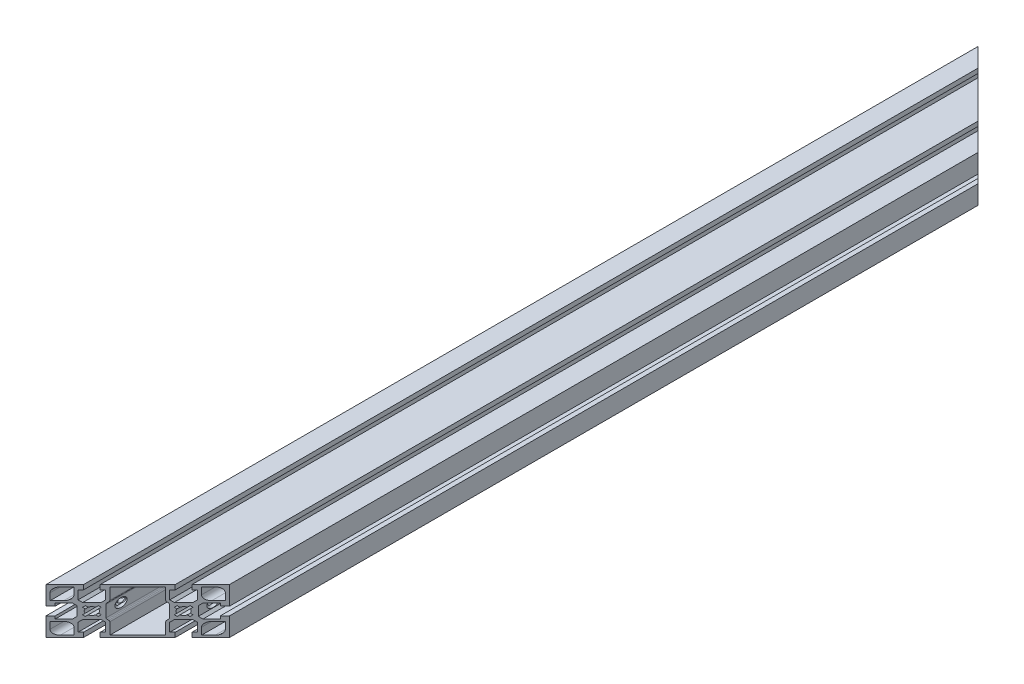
from build123d import *

# Parameters (mm, degrees)
BOSS_EXTRUDE1_DEPTH      = 457.2
BOSS_EXTRUDE1_DEPTH_BACK = 457.2
CUT_EXTRUDE1_DEPTH       = 457.2
SKETCH3_R                = 4.250000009
CUT_EXTRUDE2_DEPTH       = 457.2
SKETCH4_R                = 6.5
SKETCH4_R_2              = 4.250000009
SKETCH4_R_3              = 6.499999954
CUT_EXTRUDE3_DEPTH       = 457.2


with BuildPart() as part:
    # Sketch1 → Boss-Extrude1 (new, two sides: drawn at the far end of the back side and taken through both)
    with BuildSketch(Plane.XY.offset(-BOSS_EXTRUDE1_DEPTH_BACK)):
        Polygon((40.5, 4.1), (45, 4.1), (45, 22.5), (26.6, 22.5), (26.6, 18), (29.3, 18), (29.3, 9.5), (27, 7.2), (18, 7.2), (15.7, 9.5), (15.7, 18), (18.4, 18), (18.4, 22.5), (-18.4, 22.5), (-18.4, 18), (-15.7, 18), (-15.7, 9.5), (-18, 7.2), (-27, 7.2), (-29.3, 9.5), (-29.3, 18), (-26.6, 18), (-26.6, 22.5), (-45, 22.5), (-45, 4.1), (-40.5, 4.1), (-40.5, 6.8), (-32, 6.8), (-29.7, 4.5), (-29.7, -4.5), (-32, -6.8), (-40.5, -6.8), (-40.5, -4.1), (-45, -4.1), (-45, -22.5), (-26.6, -22.5), (-26.6, -18), (-29.3, -18), (-29.3, -9.5), (-27, -7.2), (-18, -7.2), (-15.7, -9.5), (-15.7, -18), (-18.4, -18), (-18.4, -22.5), (18.4, -22.5), (18.4, -18), (15.7, -18), (15.7, -9.5), (18, -7.2), (27, -7.2), (29.3, -9.5), (29.3, -18), (26.6, -18), (26.6, -22.5), (45, -22.5), (45, -4.1), (40.5, -4.1), (40.5, -6.8), (32, -6.8), (29.7, -4.5), (29.7, 4.5), (32, 6.8), (40.5, 6.8), align=None)
        with BuildLine():
            Line((-43, 8.799987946), (-43, 15.5))
            ThreePointArc((-43, 15.5), (-41.535533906, 19.035533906), (-38, 20.5))
            Line((-38, 20.5), (-31.30001823, 20.5))
            Line((-31.30001823, 20.5), (-31.300018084, 13.799988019))
            ThreePointArc((-31.300018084, 13.799988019), (-32.764484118, 10.264454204), (-36.300017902, 8.799988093))
            Line((-36.300017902, 8.799988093), (-43, 8.799987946))
        make_face(mode=Mode.SUBTRACT)
        with BuildLine():
            Line((-43, -15.5), (-43, -8.7999878))
            Line((-43, -8.7999878), (-36.300017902, -8.799987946))
            ThreePointArc((-36.300017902, -8.799987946), (-32.764483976, -10.264454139), (-31.300017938, -13.799988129))
            Line((-31.300017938, -13.799988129), (-31.300018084, -20.5))
            Line((-31.300018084, -20.5), (-38, -20.5))
            ThreePointArc((-38, -20.5), (-41.535533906, -19.035533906), (-43, -15.5))
        make_face(mode=Mode.SUBTRACT)
        with BuildLine():
            Line((31.300018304, -20.5), (31.300018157, -13.799988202))
            ThreePointArc((31.300018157, -13.799988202), (32.764484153, -10.264454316), (36.300017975, -8.799988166))
            Line((36.300017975, -8.799988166), (43, -8.799988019))
            Line((43, -8.799988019), (43, -15.5))
            ThreePointArc((43, -15.5), (41.535533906, -19.035533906), (38, -20.5))
            Line((38, -20.5), (31.300018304, -20.5))
        make_face(mode=Mode.SUBTRACT)
        with BuildLine():
            Line((31.300018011, 13.799988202), (31.300018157, 20.5))
            Line((31.300018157, 20.5), (38, 20.5))
            ThreePointArc((38, 20.5), (41.535533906, 19.035533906), (43, 15.5))
            Line((43, 15.5), (43, 8.799987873))
            Line((43, 8.799987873), (36.300017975, 8.799988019))
            ThreePointArc((36.300017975, 8.799988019), (32.764484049, 10.264454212), (31.300018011, 13.799988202))
        make_face(mode=Mode.SUBTRACT)
        with BuildLine():
            Line((-25.681980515, 4.596194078), (-24.348524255, 3.262737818))
            ThreePointArc((-24.348524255, 3.262737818), (-22.5, 3.749999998), (-20.651475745, 3.262737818))
            Line((-20.651475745, 3.262737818), (-19.318019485, 4.596194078))
            Line((-19.318019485, 4.596194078), (-17.903805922, 3.181980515))
            Line((-17.903805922, 3.181980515), (-19.237262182, 1.848524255))
            ThreePointArc((-19.237262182, 1.848524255), (-18.750000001, 0), (-19.237262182, -1.848524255))
            Line((-19.237262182, -1.848524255), (-17.903805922, -3.181980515))
            Line((-17.903805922, -3.181980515), (-19.318019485, -4.596194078))
            Line((-19.318019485, -4.596194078), (-20.651475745, -3.262737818))
            ThreePointArc((-20.651475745, -3.262737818), (-22.5, -3.749999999), (-24.348524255, -3.262737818))
            Line((-24.348524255, -3.262737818), (-25.681980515, -4.596194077))
            Line((-25.681980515, -4.596194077), (-27.096194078, -3.181980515))
            Line((-27.096194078, -3.181980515), (-25.762737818, -1.848524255))
            ThreePointArc((-25.762737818, -1.848524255), (-26.249999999, 0), (-25.762737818, 1.848524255))
            Line((-25.762737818, 1.848524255), (-27.096194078, 3.181980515))
            Line((-27.096194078, 3.181980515), (-25.681980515, 4.596194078))
        make_face(mode=Mode.SUBTRACT)
        with BuildLine():
            Line((19.318019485, 4.596194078), (20.651475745, 3.262737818))
            ThreePointArc((20.651475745, 3.262737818), (22.5, 3.749999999), (24.348524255, 3.262737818))
            Line((24.348524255, 3.262737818), (25.681980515, 4.596194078))
            Line((25.681980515, 4.596194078), (27.096194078, 3.181980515))
            Line((27.096194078, 3.181980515), (25.762737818, 1.848524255))
            ThreePointArc((25.762737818, 1.848524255), (26.249999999, 0), (25.762737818, -1.848524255))
            Line((25.762737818, -1.848524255), (27.096194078, -3.181980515))
            Line((27.096194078, -3.181980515), (25.681980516, -4.596194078))
            Line((25.681980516, -4.596194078), (24.348524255, -3.262737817))
            ThreePointArc((24.348524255, -3.262737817), (22.5, -3.749999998), (20.651475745, -3.262737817))
            Line((20.651475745, -3.262737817), (19.318019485, -4.596194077))
            Line((19.318019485, -4.596194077), (17.903805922, -3.181980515))
            Line((17.903805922, -3.181980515), (19.237262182, -1.848524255))
            ThreePointArc((19.237262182, -1.848524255), (18.750000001, 0), (19.237262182, 1.848524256))
            Line((19.237262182, 1.848524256), (17.903805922, 3.181980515))
            Line((17.903805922, 3.181980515), (19.318019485, 4.596194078))
        make_face(mode=Mode.SUBTRACT)
        with BuildLine():
            Line((-14.285798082, -7.785798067), (-14.914213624, -7.15738247))
            ThreePointArc((-14.914213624, -7.15738247), (-15.347759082, -6.508535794), (-15.5, -5.74316897))
            Line((-15.5, -5.74316897), (-15.5, 5.74316897))
            ThreePointArc((-15.5, 5.74316897), (-15.347759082, 6.508535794), (-14.914213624, 7.15738247))
            Line((-14.914213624, 7.15738247), (-14.285798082, 7.785798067))
            ThreePointArc((-14.285798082, 7.785798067), (-13.852252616, 8.434644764), (-13.700011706, 9.200011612))
            Line((-13.700011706, 9.200011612), (-13.700011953, 20.5))
            Line((-13.700011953, 20.5), (13.7000122, 20.5))
            Line((13.7000122, 20.5), (13.700011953, 9.200011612))
            ThreePointArc((13.700011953, 9.200011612), (13.852252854, 8.434644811), (14.285798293, 7.785798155))
            Line((14.285798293, 7.785798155), (14.914213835, 7.157382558))
            ThreePointArc((14.914213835, 7.157382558), (15.347759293, 6.508535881), (15.500000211, 5.743169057))
            Line((15.500000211, 5.743169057), (15.500000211, -5.743168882))
            ThreePointArc((15.500000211, -5.743168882), (15.347759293, -6.508535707), (14.914213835, -7.157382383))
            Line((14.914213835, -7.157382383), (14.285798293, -7.78579798))
            ThreePointArc((14.285798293, -7.78579798), (13.852252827, -8.434644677), (13.700011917, -9.200011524))
            Line((13.700011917, -9.200011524), (13.700012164, -20.499999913))
            Line((13.700012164, -20.499999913), (-13.700011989, -20.499999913))
            Line((-13.700011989, -20.499999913), (-13.700011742, -9.200011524))
            ThreePointArc((-13.700011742, -9.200011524), (-13.852252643, -8.434644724), (-14.285798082, -7.785798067))
        make_face(mode=Mode.SUBTRACT)
    extrude(amount=BOSS_EXTRUDE1_DEPTH + BOSS_EXTRUDE1_DEPTH_BACK)

    # Sketch2 → Cut-Extrude1 (cut)
    with BuildSketch(Plane(origin=(0, 22.5, 0), x_dir=(1, 0, 0), z_dir=(0, 1, 0))):
        Polygon((-18.4, -457.2), (-18.4, -430.6), (-45, -457.2), align=None)
        Polygon((18.4, -457.2), (18.4, -393.8), (-18.4, -430.6), (-18.4, -457.2), align=None)
        Polygon((45, -457.2), (45, -367.2), (18.4, -393.8), (18.4, -457.2), align=None)
    cut_extrude1 = extrude(amount=-CUT_EXTRUDE1_DEPTH, mode=Mode.SUBTRACT)

    # Sketch3 → Cut-Extrude2 (cut)
    with BuildSketch(Plane(origin=(206.1, 0, 206.1), x_dir=(0.7071067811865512, 0, -0.7071067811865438), z_dir=(0.7071067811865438, 0, 0.7071067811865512))):
        with Locations(Location((-303.039025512, 0, 0), (0, 0, 334.218086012))):
            Circle(SKETCH3_R)
        with Locations(Location((-239.259625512, 0, 0), (0, 0, 25.781913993))):
            Circle(SKETCH3_R)
    cut_extrude2 = extrude(amount=-CUT_EXTRUDE2_DEPTH, mode=Mode.SUBTRACT)

    # Sketch4 → Cut-Extrude3 (cut)
    # profile 1 of 2: a face of its own
    with BuildSketch(Plane(origin=(190.833564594, 0, 190.833564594), x_dir=(0.7071067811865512, 0, -0.7071067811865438), z_dir=(0.7071067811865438, 0, 0.7071067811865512))):
        with Locations(Location((-303.039025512, 0, 0), (0, 0, 16.522290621))):
            Circle(SKETCH4_R)
        with Locations(Location((-303.039025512, 0, 0), (0, 0, 334.218086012))):
            Circle(SKETCH4_R_2, mode=Mode.SUBTRACT)
    # profile 2 of 2: a face of its own
    with BuildSketch(Plane(origin=(190.833564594, 0, 190.833564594), x_dir=(0.7071067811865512, 0, -0.7071067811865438), z_dir=(0.7071067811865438, 0, 0.7071067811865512))):
        with Locations(Location((-239.259625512, 0, 0), (0, 0, 16.522290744))):
            Circle(SKETCH4_R_3)
        with Locations(Location((-239.259625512, 0, 0), (0, 0, 334.218086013))):
            Circle(SKETCH4_R_2, mode=Mode.SUBTRACT)
    cut_extrude3 = extrude(amount=-CUT_EXTRUDE3_DEPTH, mode=Mode.SUBTRACT)

    # Mirror1: Cut-Extrude1, Cut-Extrude2, Cut-Extrude3 across plane
    add(cut_extrude1.mirror(Plane.XY), mode=Mode.SUBTRACT)
    add(cut_extrude2.mirror(Plane.XY), mode=Mode.SUBTRACT)
    add(cut_extrude3.mirror(Plane.XY), mode=Mode.SUBTRACT)


solid = part.part
